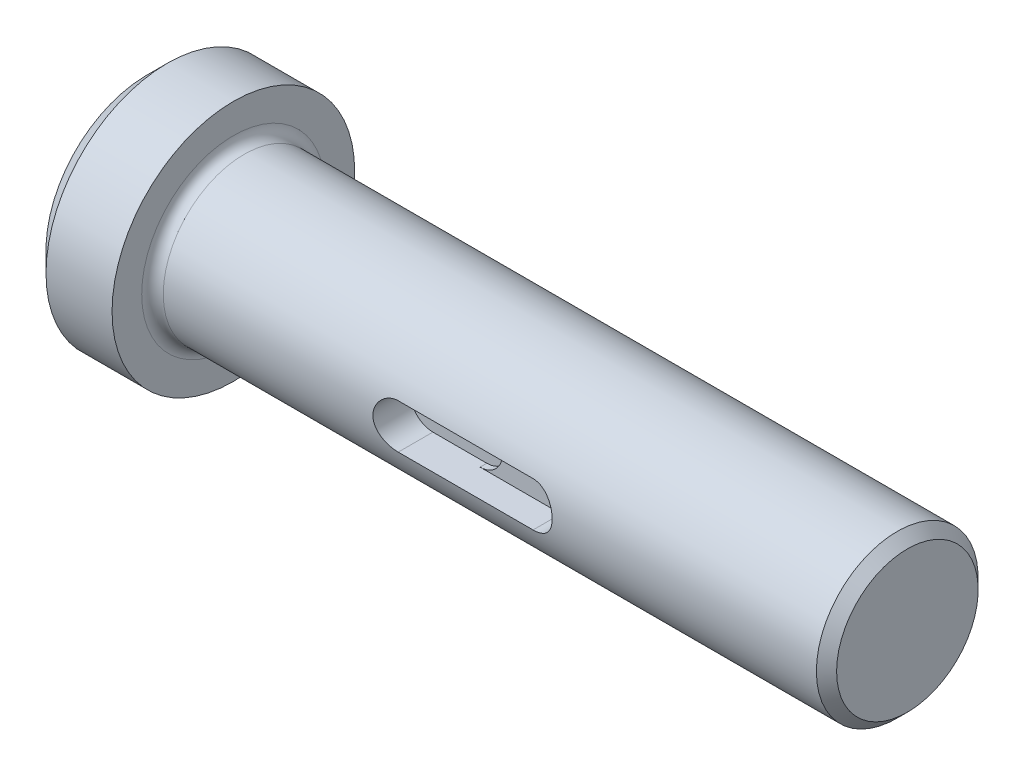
from build123d import *

# Parameters (mm, degrees)
HEADCHAMFER_SIZE   = 1.5
CUT_EXTRUDE1_DEPTH = 2.3
CUT_EXTRUDE2_DEPTH = 2.8
BODYCHAMFER_SIZE   = 0.75


with BuildPart() as part:
    # Sketch2 → Base (revolve)
    with BuildSketch(Plane.XY, mode=Mode.PRIVATE) as base_sk:
        with BuildLine():
            Line((0, 0), (0, 9))
            Line((0, 9), (6.4, 9))
            Line((6.4, 9), (6.4, 6.8))
            ThreePointArc((6.4, 6.8), (6.634314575, 6.234314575), (7.2, 6))
            Line((7.2, 6), (56.4, 6))
            Line((56.4, 6), (56.4, 0))
            Line((56.4, 0), (0, 0))
        make_face()
    revolve(base_sk.sketch.rotate(Axis((-56.067516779, 0, 0), (1, 0, 0)), 90), axis=Axis((-56.067516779, 0, 0), (1, 0, 0)))

    # HeadChamfer
    headchamfer_edges = [part.edges().sort_by_distance(p)[0] for p in [
        (0, 0, -9),
    ]]
    chamfer(headchamfer_edges, length=HEADCHAMFER_SIZE)

    # Sketch3 → Cut-Extrude1 (cut)
    with BuildSketch(Plane.XY.offset(6)):
        with BuildLine():
            Line((24.4, 1.65), (34.4, 1.65))
            ThreePointArc((34.4, 1.65), (36.05, 0), (34.4, -1.65))
            Line((34.4, -1.65), (24.4, -1.65))
            ThreePointArc((24.4, -1.65), (22.75, 0), (24.4, 1.65))
        make_face()
    extrude(amount=-CUT_EXTRUDE1_DEPTH, mode=Mode.SUBTRACT)

    # Sketch4 → Cut-Extrude2 (cut)
    with BuildSketch(Plane.XY.offset(6)):
        with BuildLine():
            Line((24.4, 1.65), (28.4, 1.65))
            ThreePointArc((28.4, 1.65), (30.05, 0), (28.4, -1.65))
            Line((28.4, -1.65), (24.4, -1.65))
            ThreePointArc((24.4, -1.65), (22.75, 0), (24.4, 1.65))
        make_face()
    extrude(amount=-CUT_EXTRUDE2_DEPTH, mode=Mode.SUBTRACT)

    # BodyChamfer
    bodychamfer_edges = [part.edges().sort_by_distance(p)[0] for p in [
        (56.4, 0, -6),
    ]]
    chamfer(bodychamfer_edges, length=BODYCHAMFER_SIZE)


solid = part.part
